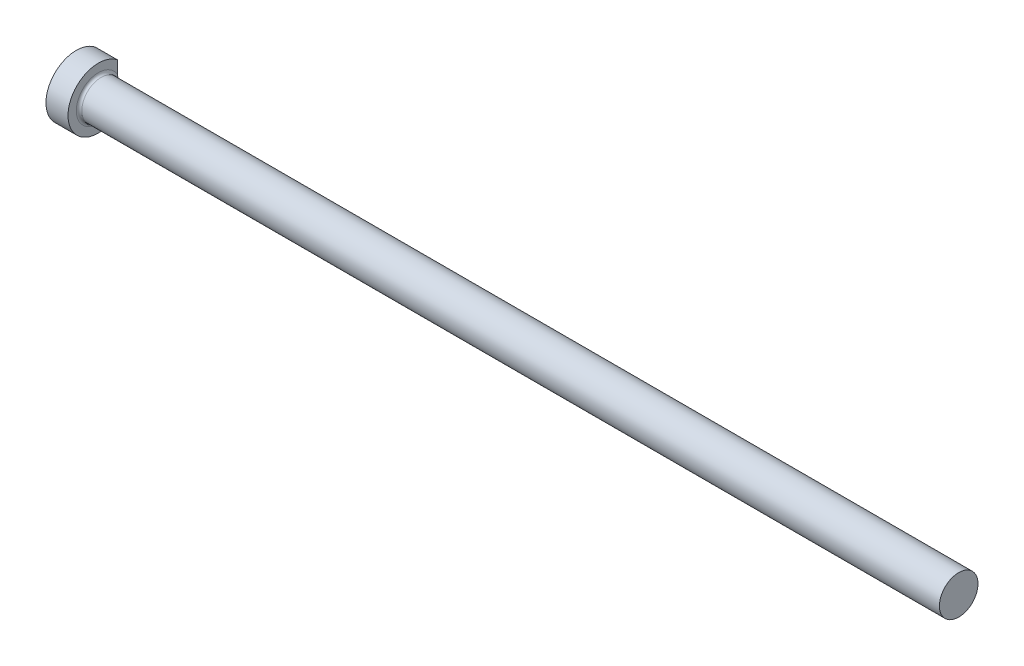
ISO-10303-21;
HEADER;
FILE_DESCRIPTION(('STEP AP214'),'2;1');
FILE_NAME('part.step','',(''),(''),'','','');
FILE_SCHEMA(('AUTOMOTIVE_DESIGN { 1 0 10303 214 1 1 1 1 }'));
ENDSEC;
DATA;
#1=APPLICATION_CONTEXT('core data for automotive mechanical design processes');
#2=APPLICATION_PROTOCOL_DEFINITION('international standard','automotive_design',2000,#1);
#3=PRODUCT_CONTEXT('',#1,'mechanical');
#4=PRODUCT('Part','Part','',(#3));
#5=PRODUCT_RELATED_PRODUCT_CATEGORY('part','',(#4));
#6=PRODUCT_DEFINITION_FORMATION('','',#4);
#7=PRODUCT_DEFINITION_CONTEXT('part definition',#1,'design');
#8=PRODUCT_DEFINITION('design','',#6,#7);
#9=PRODUCT_DEFINITION_SHAPE('','',#8);
#10=(LENGTH_UNIT() NAMED_UNIT(*) SI_UNIT(.MILLI.,.METRE.));
#11=(NAMED_UNIT(*) PLANE_ANGLE_UNIT() SI_UNIT($,.RADIAN.));
#12=(NAMED_UNIT(*) SI_UNIT($,.STERADIAN.) SOLID_ANGLE_UNIT());
#13=UNCERTAINTY_MEASURE_WITH_UNIT(LENGTH_MEASURE(1.E-05),#10,'distance_accuracy_value','');
#14=(GEOMETRIC_REPRESENTATION_CONTEXT(3) GLOBAL_UNCERTAINTY_ASSIGNED_CONTEXT((#13)) GLOBAL_UNIT_ASSIGNED_CONTEXT((#10,
#11,#12)) REPRESENTATION_CONTEXT('',''));
#15=CARTESIAN_POINT('',(0.,0.,0.));
#16=DIRECTION('',(0.,0.,1.));
#17=DIRECTION('',(1.,0.,0.));
#18=AXIS2_PLACEMENT_3D('',#15,#16,#17);
#19=CARTESIAN_POINT('',(0.,0.,0.));
#20=DIRECTION('',(1.,0.,0.));
#21=DIRECTION('',(0.,1.,0.));
#22=AXIS2_PLACEMENT_3D('',#19,#20,#21);
#23=PLANE('',#22);
#24=DIRECTION('',(0.,1.,0.));
#25=VECTOR('',#24,1.);
#26=CARTESIAN_POINT('',(0.,0.,-5.55650399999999));
#27=LINE('',#26,#25);
#28=CARTESIAN_POINT('',(0.,-6.7349825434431,-5.55650399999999));
#29=VERTEX_POINT('',#28);
#30=CARTESIAN_POINT('',(0.,6.7349825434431,-5.55650399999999));
#31=VERTEX_POINT('',#30);
#32=EDGE_CURVE('E49',#29,#31,#27,.T.);
#33=ORIENTED_EDGE('',*,*,#32,.F.);
#34=CARTESIAN_POINT('',(0.,0.,0.));
#35=DIRECTION('',(-1.,0.,0.));
#36=DIRECTION('',(0.,-1.,0.));
#37=AXIS2_PLACEMENT_3D('',#34,#35,#36);
#38=CIRCLE('',#37,8.73124999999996);
#39=EDGE_CURVE('E43',#29,#31,#38,.T.);
#40=ORIENTED_EDGE('',*,*,#39,.T.);
#41=EDGE_LOOP('',(#33,#40));
#42=FACE_BOUND('',#41,.T.);
#43=ADVANCED_FACE('F32',(#42),#23,.F.);
#44=CARTESIAN_POINT('',(254.,0.,0.));
#45=DIRECTION('',(-1.,0.,0.));
#46=DIRECTION('',(0.,-1.,0.));
#47=AXIS2_PLACEMENT_3D('',#44,#45,#46);
#48=CYLINDRICAL_SURFACE('',#47,8.73124999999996);
#49=DIRECTION('',(-1.,0.,0.));
#50=VECTOR('',#49,1.);
#51=CARTESIAN_POINT('',(254.,-6.73498254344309,-5.55650399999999));
#52=LINE('',#51,#50);
#53=CARTESIAN_POINT('',(6.34999999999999,-6.7349825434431,-5.55650399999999));
#54=VERTEX_POINT('',#53);
#55=EDGE_CURVE('E87',#54,#29,#52,.T.);
#56=ORIENTED_EDGE('',*,*,#55,.F.);
#57=CARTESIAN_POINT('',(6.34999999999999,0.,0.));
#58=DIRECTION('',(-1.,0.,0.));
#59=DIRECTION('',(0.,-1.,0.));
#60=AXIS2_PLACEMENT_3D('',#57,#58,#59);
#61=CIRCLE('',#60,8.73124999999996);
#62=CARTESIAN_POINT('',(6.34999999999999,6.73498254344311,-5.55650399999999));
#63=VERTEX_POINT('',#62);
#64=EDGE_CURVE('E75',#54,#63,#61,.T.);
#65=ORIENTED_EDGE('',*,*,#64,.T.);
#66=DIRECTION('',(-1.,0.,0.));
#67=VECTOR('',#66,1.);
#68=CARTESIAN_POINT('',(254.,6.73498254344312,-5.55650399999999));
#69=LINE('',#68,#67);
#70=EDGE_CURVE('E56',#31,#63,#69,.F.);
#71=ORIENTED_EDGE('',*,*,#70,.F.);
#72=ORIENTED_EDGE('',*,*,#39,.F.);
#73=EDGE_LOOP('',(#56,#65,#71,#72));
#74=FACE_BOUND('',#73,.T.);
#75=ADVANCED_FACE('F97',(#74),#48,.T.);
#76=CARTESIAN_POINT('',(6.35,8.73124999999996,0.));
#77=DIRECTION('',(-1.,0.,0.));
#78=DIRECTION('',(0.,-1.,0.));
#79=AXIS2_PLACEMENT_3D('',#76,#77,#78);
#80=PLANE('',#79);
#81=DIRECTION('',(0.,-1.,0.));
#82=VECTOR('',#81,1.);
#83=CARTESIAN_POINT('',(6.35,8.73124999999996,-5.55650399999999));
#84=LINE('',#83,#82);
#85=CARTESIAN_POINT('',(6.34999999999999,3.06058141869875,-5.55650399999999));
#86=VERTEX_POINT('',#85);
#87=EDGE_CURVE('E84',#63,#86,#84,.T.);
#88=ORIENTED_EDGE('',*,*,#87,.F.);
#89=ORIENTED_EDGE('',*,*,#64,.F.);
#90=CARTESIAN_POINT('',(6.35,-3.06058141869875,-5.55650399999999));
#91=VERTEX_POINT('',#90);
#92=EDGE_CURVE('E80',#91,#54,#84,.T.);
#93=ORIENTED_EDGE('',*,*,#92,.F.);
#94=CARTESIAN_POINT('',(6.34999999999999,0.,0.));
#95=DIRECTION('',(-1.,0.,0.));
#96=DIRECTION('',(0.,-1.,0.));
#97=AXIS2_PLACEMENT_3D('',#94,#95,#96);
#98=CIRCLE('',#97,6.34365);
#99=EDGE_CURVE('E70',#91,#86,#98,.T.);
#100=ORIENTED_EDGE('',*,*,#99,.T.);
#101=EDGE_LOOP('',(#88,#89,#93,#100));
#102=FACE_BOUND('',#101,.T.);
#103=ADVANCED_FACE('F81',(#102),#80,.F.);
#104=CARTESIAN_POINT('',(7.1374,0.,0.));
#105=DIRECTION('',(-1.,0.,0.));
#106=DIRECTION('',(0.,-1.,0.));
#107=AXIS2_PLACEMENT_3D('',#104,#105,#106);
#108=TOROIDAL_SURFACE('',#107,6.34365,0.787399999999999);
#109=CARTESIAN_POINT('',(7.13739999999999,0.,0.));
#110=DIRECTION('',(-1.,0.,0.));
#111=DIRECTION('',(0.,-1.,0.));
#112=AXIS2_PLACEMENT_3D('',#109,#110,#111);
#113=CIRCLE('',#112,5.55625);
#114=CARTESIAN_POINT('',(7.13739999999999,-5.55625,0.));
#115=VERTEX_POINT('',#114);
#116=EDGE_CURVE('E76',#115,#115,#113,.T.);
#117=ORIENTED_EDGE('',*,*,#116,.T.);
#118=EDGE_LOOP('',(#117));
#119=FACE_BOUND('',#118,.T.);
#120=CARTESIAN_POINT('',(7.11740163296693,0.,-5.55650399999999));
#121=CARTESIAN_POINT('',(7.11740576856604,-0.00413007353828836,-5.55650399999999));
#122=CARTESIAN_POINT('',(7.11721856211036,-0.00826023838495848,-5.55650399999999));
#123=CARTESIAN_POINT('',(7.11651357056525,-0.0164975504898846,-5.55650399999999));
#124=CARTESIAN_POINT('',(7.11599522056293,-0.0206046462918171,-5.55650399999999));
#125=CARTESIAN_POINT('',(7.11404525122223,-0.0329143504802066,-5.55650399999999));
#126=CARTESIAN_POINT('',(7.11222039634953,-0.0410513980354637,-5.55650399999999));
#127=CARTESIAN_POINT('',(7.10600153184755,-0.0654782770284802,-5.55650399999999));
#128=CARTESIAN_POINT('',(7.1008926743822,-0.0815662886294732,-5.55650399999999));
#129=CARTESIAN_POINT('',(7.08479066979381,-0.130203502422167,-5.55650399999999));
#130=CARTESIAN_POINT('',(7.07318638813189,-0.162533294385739,-5.55650399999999));
#131=CARTESIAN_POINT('',(7.04938592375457,-0.228192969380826,-5.55650399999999));
#132=CARTESIAN_POINT('',(7.03718288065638,-0.261520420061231,-5.55650399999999));
#133=CARTESIAN_POINT('',(7.01285124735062,-0.327795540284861,-5.55650399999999));
#134=CARTESIAN_POINT('',(7.00072326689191,-0.360743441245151,-5.55650399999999));
#135=CARTESIAN_POINT('',(6.94494101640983,-0.512614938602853,-5.55650399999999));
#136=CARTESIAN_POINT('',(6.90156402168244,-0.631642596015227,-5.55650399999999));
#137=CARTESIAN_POINT('',(6.81668502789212,-0.870902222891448,-5.55650399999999));
#138=CARTESIAN_POINT('',(6.77519112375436,-0.991137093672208,-5.55650399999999));
#139=CARTESIAN_POINT('',(6.69595289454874,-1.23100396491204,-5.55650399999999));
#140=CARTESIAN_POINT('',(6.65816464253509,-1.35062129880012,-5.55650399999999));
#141=CARTESIAN_POINT('',(6.58697638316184,-1.59102161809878,-5.55650399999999));
#142=CARTESIAN_POINT('',(6.55357141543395,-1.71180311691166,-5.55650399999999));
#143=CARTESIAN_POINT('',(6.49185550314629,-1.95749479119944,-5.55650399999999));
#144=CARTESIAN_POINT('',(6.46367167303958,-2.08243753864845,-5.55650399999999));
#145=CARTESIAN_POINT('',(6.41519237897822,-2.33382283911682,-5.55650399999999));
#146=CARTESIAN_POINT('',(6.39489362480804,-2.46026474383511,-5.55650399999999));
#147=CARTESIAN_POINT('',(6.36455835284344,-2.71431542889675,-5.55650399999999));
#148=CARTESIAN_POINT('',(6.35450871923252,-2.84192250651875,-5.55650399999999));
#149=CARTESIAN_POINT('',(6.34953893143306,-3.03349390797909,-5.55650399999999));
#150=CARTESIAN_POINT('',(6.34956241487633,-3.09732692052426,-5.55650399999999));
#151=CARTESIAN_POINT('',(6.35350245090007,-3.22486608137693,-5.55650399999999));
#152=CARTESIAN_POINT('',(6.35741892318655,-3.28857223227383,-5.55650399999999));
#153=CARTESIAN_POINT('',(6.37334213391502,-3.4524286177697,-5.55650399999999));
#154=CARTESIAN_POINT('',(6.38872035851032,-3.55232112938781,-5.55650399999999));
#155=CARTESIAN_POINT('',(6.42265258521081,-3.69950491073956,-5.55650399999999));
#156=CARTESIAN_POINT('',(6.43575241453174,-3.74806820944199,-5.55650399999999));
#157=CARTESIAN_POINT('',(6.46611260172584,-3.84386337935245,-5.55650399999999));
#158=CARTESIAN_POINT('',(6.48336962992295,-3.89109628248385,-5.55650399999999));
#159=CARTESIAN_POINT('',(6.52297300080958,-3.98426072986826,-5.55650399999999));
#160=CARTESIAN_POINT('',(6.54539277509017,-4.03016154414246,-5.55650399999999));
#161=CARTESIAN_POINT('',(6.59593670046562,-4.11877499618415,-5.55650399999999));
#162=CARTESIAN_POINT('',(6.62405900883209,-4.16148865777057,-5.55650399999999));
#163=CARTESIAN_POINT('',(6.68126758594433,-4.23491309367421,-5.55650399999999));
#164=CARTESIAN_POINT('',(6.70932538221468,-4.26641666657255,-5.55650399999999));
#165=CARTESIAN_POINT('',(6.77011453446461,-4.32456313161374,-5.55650399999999));
#166=CARTESIAN_POINT('',(6.80283730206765,-4.35121475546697,-5.55650399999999));
#167=CARTESIAN_POINT('',(6.86388074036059,-4.39181389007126,-5.55650399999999));
#168=CARTESIAN_POINT('',(6.89119463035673,-4.40726781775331,-5.55650399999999));
#169=CARTESIAN_POINT('',(6.94798953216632,-4.43352212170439,-5.55650399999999));
#170=CARTESIAN_POINT('',(6.97746891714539,-4.44432595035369,-5.55650399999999));
#171=CARTESIAN_POINT('',(7.0381286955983,-4.46052484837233,-5.55650399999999));
#172=CARTESIAN_POINT('',(7.06931967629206,-4.46588098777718,-5.55650399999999));
#173=CARTESIAN_POINT('',(7.13215023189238,-4.47055157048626,-5.55650399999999));
#174=CARTESIAN_POINT('',(7.16378961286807,-4.46986855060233,-5.55650399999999));
#175=CARTESIAN_POINT('',(7.2229840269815,-4.46293445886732,-5.55650399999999));
#176=CARTESIAN_POINT('',(7.25061287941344,-4.45728903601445,-5.55650399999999));
#177=CARTESIAN_POINT('',(7.30460472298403,-4.44166041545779,-5.55650399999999));
#178=CARTESIAN_POINT('',(7.33096728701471,-4.43167576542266,-5.55650399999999));
#179=CARTESIAN_POINT('',(7.38943247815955,-4.40447242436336,-5.55650399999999));
#180=CARTESIAN_POINT('',(7.42094588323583,-4.38599022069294,-5.55650399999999));
#181=CARTESIAN_POINT('',(7.48054453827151,-4.34415394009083,-5.55650399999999));
#182=CARTESIAN_POINT('',(7.50862348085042,-4.32079110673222,-5.55650399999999));
#183=CARTESIAN_POINT('',(7.57261389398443,-4.25959520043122,-5.55650399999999));
#184=CARTESIAN_POINT('',(7.60669784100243,-4.21986099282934,-5.55650399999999));
#185=CARTESIAN_POINT('',(7.66827614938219,-4.13562424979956,-5.55650399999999));
#186=CARTESIAN_POINT('',(7.69575756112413,-4.09111258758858,-5.55650399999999));
#187=CARTESIAN_POINT('',(7.76046417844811,-3.97004458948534,-5.55650399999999));
#188=CARTESIAN_POINT('',(7.79292596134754,-3.89096161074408,-5.55650399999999));
#189=CARTESIAN_POINT('',(7.84581488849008,-3.72893355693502,-5.55650399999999));
#190=CARTESIAN_POINT('',(7.86621348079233,-3.64597981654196,-5.55650399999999));
#191=CARTESIAN_POINT('',(7.8961007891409,-3.48530633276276,-5.55650399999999));
#192=CARTESIAN_POINT('',(7.90635386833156,-3.40772292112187,-5.55650399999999));
#193=CARTESIAN_POINT('',(7.92020649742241,-3.2519343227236,-5.55650399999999));
#194=CARTESIAN_POINT('',(7.9238002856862,-3.17372865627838,-5.55650399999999));
#195=CARTESIAN_POINT('',(7.92543759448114,-3.01712527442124,-5.55650399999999));
#196=CARTESIAN_POINT('',(7.92346998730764,-2.93872748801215,-5.55650399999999));
#197=CARTESIAN_POINT('',(7.91484518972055,-2.78218272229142,-5.55650399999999));
#198=CARTESIAN_POINT('',(7.90818649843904,-2.70403583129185,-5.55650399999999));
#199=CARTESIAN_POINT('',(7.88703038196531,-2.51325999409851,-5.55650399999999));
#200=CARTESIAN_POINT('',(7.87035727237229,-2.40087427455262,-5.55650399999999));
#201=CARTESIAN_POINT('',(7.83044317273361,-2.17726298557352,-5.55650399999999));
#202=CARTESIAN_POINT('',(7.80719919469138,-2.06603796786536,-5.55650399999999));
#203=CARTESIAN_POINT('',(7.75568076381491,-1.84547893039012,-5.55650399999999));
#204=CARTESIAN_POINT('',(7.7274372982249,-1.73613757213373,-5.55650399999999));
#205=CARTESIAN_POINT('',(7.66696454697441,-1.51863552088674,-5.55650399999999));
#206=CARTESIAN_POINT('',(7.63473727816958,-1.41047426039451,-5.55650399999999));
#207=CARTESIAN_POINT('',(7.57405955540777,-1.2168600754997,-5.55650399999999));
#208=CARTESIAN_POINT('',(7.54616072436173,-1.13123243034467,-5.55650399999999));
#209=CARTESIAN_POINT('',(7.48882196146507,-0.960368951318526,-5.55650399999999));
#210=CARTESIAN_POINT('',(7.45938001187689,-0.875133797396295,-5.55650399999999));
#211=CARTESIAN_POINT('',(7.3986280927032,-0.702789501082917,-5.55650399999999));
#212=CARTESIAN_POINT('',(7.36728929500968,-0.615690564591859,-5.55650399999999));
#213=CARTESIAN_POINT('',(7.30406481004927,-0.442193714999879,-5.55650399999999));
#214=CARTESIAN_POINT('',(7.27218269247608,-0.355794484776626,-5.55650399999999));
#215=CARTESIAN_POINT('',(7.23202543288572,-0.246240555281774,-5.55650399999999));
#216=CARTESIAN_POINT('',(7.22357742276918,-0.22315207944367,-5.55650399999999));
#217=CARTESIAN_POINT('',(7.2067174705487,-0.176600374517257,-5.55650399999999));
#218=CARTESIAN_POINT('',(7.19830767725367,-0.153136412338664,-5.55650399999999));
#219=CARTESIAN_POINT('',(7.18231236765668,-0.107298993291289,-5.55650399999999));
#220=CARTESIAN_POINT('',(7.17470677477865,-0.0849333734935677,-5.55650399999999));
#221=CARTESIAN_POINT('',(7.16502208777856,-0.0511624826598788,-5.55650399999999));
#222=CARTESIAN_POINT('',(7.16210828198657,-0.0400143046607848,-5.55650399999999));
#223=CARTESIAN_POINT('',(7.15815878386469,-0.0174378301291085,-5.55650399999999));
#224=CARTESIAN_POINT('',(7.15709991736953,-0.00601482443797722,-5.55650399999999));
#225=CARTESIAN_POINT('',(7.15790955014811,0.0170142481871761,-5.55650399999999));
#226=CARTESIAN_POINT('',(7.15985953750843,0.0286166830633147,-5.55650399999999));
#227=CARTESIAN_POINT('',(7.165053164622,0.0516041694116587,-5.55650399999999));
#228=CARTESIAN_POINT('',(7.16831424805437,0.0629840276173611,-5.55650399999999));
#229=CARTESIAN_POINT('',(7.17890286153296,0.0975984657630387,-5.55650399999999));
#230=CARTESIAN_POINT('',(7.18688239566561,0.120637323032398,-5.55650399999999));
#231=CARTESIAN_POINT('',(7.20362466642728,0.16802483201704,-5.55650399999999));
#232=CARTESIAN_POINT('',(7.2124052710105,0.192366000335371,-5.55650399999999));
#233=CARTESIAN_POINT('',(7.22997579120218,0.240672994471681,-5.55650399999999));
#234=CARTESIAN_POINT('',(7.23876393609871,0.264639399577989,-5.55650399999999));
#235=CARTESIAN_POINT('',(7.28312509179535,0.385498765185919,-5.55650399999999));
#236=CARTESIAN_POINT('',(7.31881409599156,0.482345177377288,-5.55650399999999));
#237=CARTESIAN_POINT('',(7.38937073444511,0.676903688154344,-5.55650399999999));
#238=CARTESIAN_POINT('',(7.42423322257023,0.774617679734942,-5.55650399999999));
#239=CARTESIAN_POINT('',(7.49152253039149,0.968203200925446,-5.55650399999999));
#240=CARTESIAN_POINT('',(7.52398810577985,1.06406118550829,-5.55650399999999));
#241=CARTESIAN_POINT('',(7.58673971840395,1.25635222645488,-5.55650399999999));
#242=CARTESIAN_POINT('',(7.61702857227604,1.35278435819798,-5.55650399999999));
#243=CARTESIAN_POINT('',(7.680270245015,1.5647022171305,-5.55650399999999));
#244=CARTESIAN_POINT('',(7.71265266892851,1.68036035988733,-5.55650399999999));
#245=CARTESIAN_POINT('',(7.77228288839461,1.91308663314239,-5.55650399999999));
#246=CARTESIAN_POINT('',(7.79952761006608,2.03015556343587,-5.55650399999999));
#247=CARTESIAN_POINT('',(7.84739270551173,2.2658218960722,-5.55650399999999));
#248=CARTESIAN_POINT('',(7.86800471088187,2.38442103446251,-5.55650399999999));
#249=CARTESIAN_POINT('',(7.90066622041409,2.62274902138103,-5.55650399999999));
#250=CARTESIAN_POINT('',(7.9127228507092,2.74247684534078,-5.55650399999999));
#251=CARTESIAN_POINT('',(7.92475620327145,2.96308362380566,-5.55650399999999));
#252=CARTESIAN_POINT('',(7.92637730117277,3.06386454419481,-5.55650399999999));
#253=CARTESIAN_POINT('',(7.91993525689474,3.26540339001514,-5.55650399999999));
#254=CARTESIAN_POINT('',(7.91184941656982,3.36616070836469,-5.55650399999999));
#255=CARTESIAN_POINT('',(7.88309380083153,3.56739114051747,-5.55650399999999));
#256=CARTESIAN_POINT('',(7.8622670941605,3.6678447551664,-5.55650399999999));
#257=CARTESIAN_POINT('',(7.81861040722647,3.81461287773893,-5.55650399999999));
#258=CARTESIAN_POINT('',(7.8020339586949,3.86279157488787,-5.55650399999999));
#259=CARTESIAN_POINT('',(7.76410900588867,3.95720907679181,-5.55650399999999));
#260=CARTESIAN_POINT('',(7.74276668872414,4.00345030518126,-5.55650399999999));
#261=CARTESIAN_POINT('',(7.6981850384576,4.08630226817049,-5.55650399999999));
#262=CARTESIAN_POINT('',(7.67570722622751,4.12331879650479,-5.55650399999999));
#263=CARTESIAN_POINT('',(7.62625860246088,4.19432994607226,-5.55650399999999));
#264=CARTESIAN_POINT('',(7.59928350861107,4.22832163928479,-5.55650399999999));
#265=CARTESIAN_POINT('',(7.54009022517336,4.29226497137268,-5.55650399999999));
#266=CARTESIAN_POINT('',(7.5078112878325,4.32216141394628,-5.55650399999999));
#267=CARTESIAN_POINT('',(7.43820024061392,4.37534550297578,-5.55650399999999));
#268=CARTESIAN_POINT('',(7.4008841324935,4.39865338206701,-5.55650399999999));
#269=CARTESIAN_POINT('',(7.33500591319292,4.43007716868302,-5.55650399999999));
#270=CARTESIAN_POINT('',(7.30762167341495,4.44066816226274,-5.55650399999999));
#271=CARTESIAN_POINT('',(7.25146754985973,4.45715240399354,-5.55650399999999));
#272=CARTESIAN_POINT('',(7.22269874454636,4.46304924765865,-5.55650399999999));
#273=CARTESIAN_POINT('',(7.16446082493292,4.46970425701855,-5.55650399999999));
#274=CARTESIAN_POINT('',(7.13498959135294,4.47044415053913,-5.55650399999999));
#275=CARTESIAN_POINT('',(7.07638544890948,4.46667534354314,-5.55650399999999));
#276=CARTESIAN_POINT('',(7.04725258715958,4.4621659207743,-5.55650399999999));
#277=CARTESIAN_POINT('',(6.99154720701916,4.44859210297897,-5.55650399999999));
#278=CARTESIAN_POINT('',(6.96491874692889,4.43975283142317,-5.55650399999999));
#279=CARTESIAN_POINT('',(6.91329192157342,4.41820226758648,-5.55650399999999));
#280=CARTESIAN_POINT('',(6.88829423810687,4.40548936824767,-5.55650399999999));
#281=CARTESIAN_POINT('',(6.82985886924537,4.37063092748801,-5.55650399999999));
#282=CARTESIAN_POINT('',(6.79743677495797,4.34678260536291,-5.55650399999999));
#283=CARTESIAN_POINT('',(6.736841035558,4.29420036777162,-5.55650399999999));
#284=CARTESIAN_POINT('',(6.70867665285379,4.26545608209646,-5.55650399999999));
#285=CARTESIAN_POINT('',(6.64360753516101,4.18949706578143,-5.55650399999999));
#286=CARTESIAN_POINT('',(6.60920980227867,4.1401474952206,-5.55650399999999));
#287=CARTESIAN_POINT('',(6.54835122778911,4.03679967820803,-5.55650399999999));
#288=CARTESIAN_POINT('',(6.52190911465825,3.98279084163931,-5.55650399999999));
#289=CARTESIAN_POINT('',(6.47934567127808,3.88056983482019,-5.55650399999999));
#290=CARTESIAN_POINT('',(6.46226141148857,3.83274900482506,-5.55650399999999));
#291=CARTESIAN_POINT('',(6.43228274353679,3.73579818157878,-5.55650399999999));
#292=CARTESIAN_POINT('',(6.41939127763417,3.68666729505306,-5.55650399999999));
#293=CARTESIAN_POINT('',(6.38616986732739,3.53800817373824,-5.55650399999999));
#294=CARTESIAN_POINT('',(6.37130787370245,3.43725253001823,-5.55650399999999));
#295=CARTESIAN_POINT('',(6.35322622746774,3.2389475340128,-5.55650399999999));
#296=CARTESIAN_POINT('',(6.34956334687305,3.1414317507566,-5.55650399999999));
#297=CARTESIAN_POINT('',(6.35051852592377,2.94637801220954,-5.55650399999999));
#298=CARTESIAN_POINT('',(6.35514460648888,2.84884012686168,-5.55650399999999));
#299=CARTESIAN_POINT('',(6.3711055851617,2.65433636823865,-5.55650399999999));
#300=CARTESIAN_POINT('',(6.382441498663,2.55737058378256,-5.55650399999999));
#301=CARTESIAN_POINT('',(6.41057573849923,2.36430715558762,-5.55650399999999));
#302=CARTESIAN_POINT('',(6.42737110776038,2.26820907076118,-5.55650399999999));
#303=CARTESIAN_POINT('',(6.46467114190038,2.08072440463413,-5.55650399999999));
#304=CARTESIAN_POINT('',(6.48500151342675,1.98930256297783,-5.55650399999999));
#305=CARTESIAN_POINT('',(6.52907222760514,1.80717748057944,-5.55650399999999));
#306=CARTESIAN_POINT('',(6.55281660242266,1.71647522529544,-5.55650399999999));
#307=CARTESIAN_POINT('',(6.60357277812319,1.5340149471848,-5.55650399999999));
#308=CARTESIAN_POINT('',(6.63064099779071,1.44227272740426,-5.55650399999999));
#309=CARTESIAN_POINT('',(6.67288206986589,1.30542816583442,-5.55650399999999));
#310=CARTESIAN_POINT('',(6.68719648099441,1.26005765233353,-5.55650399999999));
#311=CARTESIAN_POINT('',(6.7163196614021,1.16949055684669,-5.55650399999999));
#312=CARTESIAN_POINT('',(6.73112827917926,1.12429392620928,-5.55650399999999));
#313=CARTESIAN_POINT('',(6.76211086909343,1.03124832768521,-5.55650399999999));
#314=CARTESIAN_POINT('',(6.77831257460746,0.98340861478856,-5.55650399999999));
#315=CARTESIAN_POINT('',(6.81115102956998,0.887813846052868,-5.55650399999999));
#316=CARTESIAN_POINT('',(6.82778828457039,0.840058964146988,-5.55650399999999));
#317=CARTESIAN_POINT('',(6.86180960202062,0.743521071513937,-5.55650399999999));
#318=CARTESIAN_POINT('',(6.87920200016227,0.694741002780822,-5.55650399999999));
#319=CARTESIAN_POINT('',(6.9141805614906,0.597513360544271,-5.55650399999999));
#320=CARTESIAN_POINT('',(6.9317654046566,0.549065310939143,-5.55650399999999));
#321=CARTESIAN_POINT('',(6.96525135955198,0.457335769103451,-5.55650399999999));
#322=CARTESIAN_POINT('',(6.9811346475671,0.414047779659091,-5.55650399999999));
#323=CARTESIAN_POINT('',(7.01322871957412,0.326740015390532,-5.55650399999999));
#324=CARTESIAN_POINT('',(7.02944040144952,0.282720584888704,-5.55650399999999));
#325=CARTESIAN_POINT('',(7.05286566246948,0.218598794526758,-5.55650399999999));
#326=CARTESIAN_POINT('',(7.06016993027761,0.198530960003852,-5.55650399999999));
#327=CARTESIAN_POINT('',(7.0746869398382,0.158142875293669,-5.55650399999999));
#328=CARTESIAN_POINT('',(7.0818980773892,0.137822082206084,-5.55650399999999));
#329=CARTESIAN_POINT('',(7.09555734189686,0.098075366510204,-5.55650399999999));
#330=CARTESIAN_POINT('',(7.10202563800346,0.0786572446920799,-5.55650399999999));
#331=CARTESIAN_POINT('',(7.11022788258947,0.0492999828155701,-5.55650399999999));
#332=CARTESIAN_POINT('',(7.11269392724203,0.0395773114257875,-5.55650399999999));
#333=CARTESIAN_POINT('',(7.11627088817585,0.0199017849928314,-5.55650399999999));
#334=CARTESIAN_POINT('',(7.11739166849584,0.00995115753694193,-5.55650399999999));
#335=CARTESIAN_POINT('',(7.11740163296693,0.,-5.55650399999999));
#336=B_SPLINE_CURVE_WITH_KNOTS('',3,(#120,#121,#122,#123,#124,#125,#126,#127,#128,#129,#130,
#131,#132,#133,#134,#135,#136,#137,#138,#139,#140,#141,#142,#143,#144,#145,#146,#147,#148,#149,
#150,#151,#152,#153,#154,#155,#156,#157,#158,#159,#160,#161,#162,#163,#164,#165,#166,#167,#168,
#169,#170,#171,#172,#173,#174,#175,#176,#177,#178,#179,#180,#181,#182,#183,#184,#185,#186,#187,
#188,#189,#190,#191,#192,#193,#194,#195,#196,#197,#198,#199,#200,#201,#202,#203,#204,#205,#206,
#207,#208,#209,#210,#211,#212,#213,#214,#215,#216,#217,#218,#219,#220,#221,#222,#223,#224,#225,
#226,#227,#228,#229,#230,#231,#232,#233,#234,#235,#236,#237,#238,#239,#240,#241,#242,#243,#244,
#245,#246,#247,#248,#249,#250,#251,#252,#253,#254,#255,#256,#257,#258,#259,#260,#261,#262,#263,
#264,#265,#266,#267,#268,#269,#270,#271,#272,#273,#274,#275,#276,#277,#278,#279,#280,#281,#282,
#283,#284,#285,#286,#287,#288,#289,#290,#291,#292,#293,#294,#295,#296,#297,#298,#299,#300,#301,
#302,#303,#304,#305,#306,#307,#308,#309,#310,#311,#312,#313,#314,#315,#316,#317,#318,#319,#320,
#321,#322,#323,#324,#325,#326,#327,#328,#329,#330,#331,#332,#333,#334,#335),.UNSPECIFIED.,.T.,
.F.,(4,2,2,2,2,2,2,2,2,2,2,2,2,2,2,2,2,2,2,2,2,2,2,2,2,2,2,2,2,2,2,2,2,2,2,2,2,2,2,2,2,2,2,2,2,
2,2,2,2,2,2,2,2,2,2,2,2,2,2,2,2,2,2,2,2,2,2,2,2,2,2,2,2,2,2,2,2,2,2,2,2,2,2,2,2,2,2,2,2,2,2,2,2,
2,2,2,2,2,2,2,2,2,2,2,2,2,2,4),(0.,0.0123869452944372,0.0247950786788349,0.0497718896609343,
0.100377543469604,0.203428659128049,0.309901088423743,0.415228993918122,0.795276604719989,
1.17682744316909,1.55310044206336,1.92894388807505,2.31299158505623,2.69687885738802,
3.08027424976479,3.2716672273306,3.46305625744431,3.76526944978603,3.91602247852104,
4.06665516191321,4.21957947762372,4.37245445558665,4.49859706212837,4.62451036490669,
4.71830022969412,4.81202034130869,4.9064055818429,5.00075117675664,5.08496798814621,
5.16921300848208,5.27820988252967,5.38740401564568,5.54357647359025,5.70005277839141,
5.95507544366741,6.21069932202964,6.44512784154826,6.67975909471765,6.91486014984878,
7.15003645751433,7.49061669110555,7.83135204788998,8.17004507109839,8.50856732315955,
8.77872500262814,9.04924520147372,9.32693523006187,9.60322013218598,9.67697465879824,
9.75175851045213,9.82259366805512,9.85712697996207,9.89122569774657,9.92626424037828,
9.96178525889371,10.0348869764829,10.1125271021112,10.1891050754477,10.4987484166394,
10.8099784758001,11.1135799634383,11.4167812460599,11.7770083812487,12.137450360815,
12.4983453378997,12.8589393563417,13.1609474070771,13.4636630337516,13.7701844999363,
13.9228392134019,14.0752968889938,14.2049453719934,14.334718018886,14.4660964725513,
14.597066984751,14.6847927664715,14.772451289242,14.8604202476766,14.9484013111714,
15.0322282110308,15.1160899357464,15.2361576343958,15.3564828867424,15.5359426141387,
15.7158215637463,15.8679468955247,16.0201787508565,16.3247665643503,16.6171325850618,
16.9097816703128,17.2024750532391,17.4950101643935,17.7758989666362,18.0571222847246,
18.344039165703,18.486762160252,18.6294417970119,18.7809658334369,18.9326743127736,
19.0880369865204,19.242658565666,19.3809879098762,19.521719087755,19.5857842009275,
19.6504787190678,19.711841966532,19.7419093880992,19.7717549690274),.UNSPECIFIED.);
#337=EDGE_CURVE('E12',#86,#91,#336,.T.);
#338=ORIENTED_EDGE('',*,*,#337,.F.);
#339=ORIENTED_EDGE('',*,*,#99,.F.);
#340=EDGE_LOOP('',(#338,#339));
#341=FACE_BOUND('',#340,.T.);
#342=ADVANCED_FACE('F72',(#119,#341),#108,.F.);
#343=CARTESIAN_POINT('',(254.,0.,0.));
#344=DIRECTION('',(-1.,0.,0.));
#345=DIRECTION('',(0.,-1.,0.));
#346=AXIS2_PLACEMENT_3D('',#343,#344,#345);
#347=CYLINDRICAL_SURFACE('',#346,5.55624999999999);
#348=ORIENTED_EDGE('',*,*,#116,.F.);
#349=EDGE_LOOP('',(#348));
#350=FACE_BOUND('',#349,.T.);
#351=CARTESIAN_POINT('',(254.,0.,0.));
#352=DIRECTION('',(-1.,0.,0.));
#353=DIRECTION('',(0.,-1.,0.));
#354=AXIS2_PLACEMENT_3D('',#351,#352,#353);
#355=CIRCLE('',#354,5.55624999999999);
#356=CARTESIAN_POINT('',(254.,-5.55624999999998,0.));
#357=VERTEX_POINT('',#356);
#358=EDGE_CURVE('E92',#357,#357,#355,.T.);
#359=ORIENTED_EDGE('',*,*,#358,.T.);
#360=EDGE_LOOP('',(#359));
#361=FACE_BOUND('',#360,.T.);
#362=ADVANCED_FACE('F107',(#350,#361),#347,.T.);
#363=CARTESIAN_POINT('',(254.,5.55625,0.));
#364=DIRECTION('',(-1.,0.,0.));
#365=DIRECTION('',(0.,-1.,0.));
#366=AXIS2_PLACEMENT_3D('',#363,#364,#365);
#367=PLANE('',#366);
#368=ORIENTED_EDGE('',*,*,#358,.F.);
#369=EDGE_LOOP('',(#368));
#370=FACE_BOUND('',#369,.T.);
#371=ADVANCED_FACE('F111',(#370),#367,.F.);
#372=CARTESIAN_POINT('',(0.,0.,-5.55650399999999));
#373=DIRECTION('',(0.,0.,-1.));
#374=DIRECTION('',(0.,1.,0.));
#375=AXIS2_PLACEMENT_3D('',#372,#373,#374);
#376=PLANE('',#375);
#377=ORIENTED_EDGE('',*,*,#55,.T.);
#378=ORIENTED_EDGE('',*,*,#32,.T.);
#379=ORIENTED_EDGE('',*,*,#70,.T.);
#380=ORIENTED_EDGE('',*,*,#87,.T.);
#381=ORIENTED_EDGE('',*,*,#337,.T.);
#382=ORIENTED_EDGE('',*,*,#92,.T.);
#383=EDGE_LOOP('',(#377,#378,#379,#380,#381,#382));
#384=FACE_BOUND('',#383,.T.);
#385=ADVANCED_FACE('F86',(#384),#376,.T.);
#386=CLOSED_SHELL('',(#43,#75,#103,#342,#362,#371,#385));
#387=MANIFOLD_SOLID_BREP('B2',#386);
#388=ADVANCED_BREP_SHAPE_REPRESENTATION('',(#18,#387),#14);
#389=SHAPE_DEFINITION_REPRESENTATION(#9,#388);
ENDSEC;
END-ISO-10303-21;
